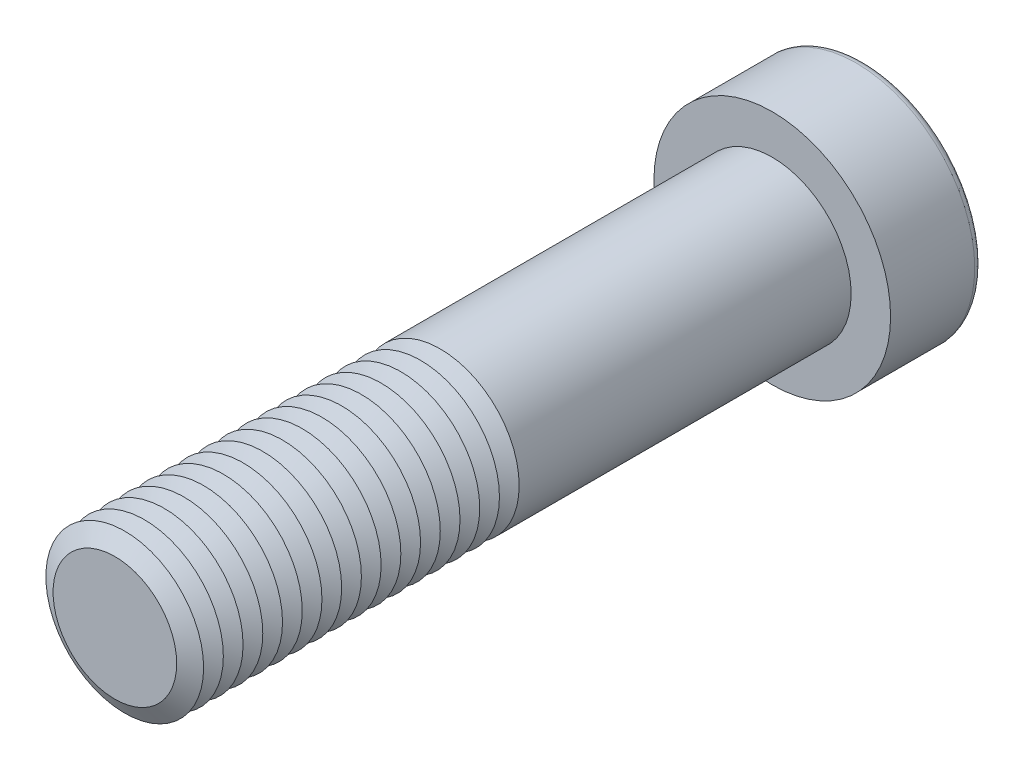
from build123d import *

# Parameters (mm, degrees)
SKETCH1_R           = 12
BOSS_EXTRUDE1_DEPTH = 100
SKETCH2_R           = 18
BOSS_EXTRUDE2_DEPTH = 14
CUT_EXTRUDE1_DEPTH  = 14.25
FILLET1_R           = 1.2
LPATTERN1_COUNT     = 17
LPATTERN1_PITCH     = 3


with BuildPart() as part:
    # Sketch1 → Boss-Extrude1 (new body)
    with BuildSketch(Plane.XY):
        Circle(SKETCH1_R)
    extrude(amount=BOSS_EXTRUDE1_DEPTH)

    # Sketch2 → Boss-Extrude2 (add)
    with BuildSketch(Plane(origin=(0, 0, 0), x_dir=(-1, 0, 0), z_dir=(0, 0, -1))):
        Circle(SKETCH2_R)
    extrude(amount=BOSS_EXTRUDE2_DEPTH)

    # Sketch3 → Cut-Extrude1 (cut)
    with BuildSketch(Plane(origin=(0, 0, -14), x_dir=(-1, 0, 0), z_dir=(0, 0, -1))):
        Polygon((-5.484827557, 9.5), (-10.969655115, 0), (-5.484827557, -9.5), (5.484827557, -9.5), (10.969655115, 0), (5.484827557, 9.5), align=None)
    extrude(amount=-CUT_EXTRUDE1_DEPTH, mode=Mode.SUBTRACT)

    # Fillet1
    fillet1_edges = [part.edges().sort_by_distance(p)[0] for p in [
        (18, 0, -14),
    ]]
    fillet(fillet1_edges, radius=FILLET1_R)

    # Cut-Extrude2 cone 1 section (on through the dimple's axis) → Cut-Extrude2 (revolve, cut)
    with BuildSketch(Plane(origin=(0, 0, 0.25), x_dir=(0, 1, 0), z_dir=(1, 0, 0))):
        Polygon((0, 0), (9.5, 0), (0, 5.484827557), align=None)
    revolve(axis=Axis((0, 0, 0.25), (0, 0, 1)), mode=Mode.SUBTRACT)

    # Cut-Extrude3 cone 1 section (on through the dimple's axis) → Cut-Extrude3 (revolve, cut)
    with BuildSketch(Plane(origin=(0, 0, -14), x_dir=(0, 1, 0), z_dir=(1, 0, 0))):
        Polygon((0, 0), (10.969655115, 0), (0, 2.939310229), align=None)
    revolve(axis=Axis((0, 0, -14), (0, 0, 1)), mode=Mode.SUBTRACT)

    # Sketch7 → Cut-Revolve1 (revolve, cut)
    with BuildSketch(Plane(origin=(0, 0, 0), x_dir=(0, 0, -1), z_dir=(1, 0, 0)), mode=Mode.PRIVATE) as cut_revolve1_sk:
        Polygon((-100, 9.401923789), (-98.5, 12), (-101.5, 12), align=None)
    cut_revolve1 = revolve(cut_revolve1_sk.sketch.rotate(Axis((0, 0, 100), (0, 0, -1)), 90), axis=Axis((0, 0, 100), (0, 0, -1)), mode=Mode.SUBTRACT)

    # LPattern1: Cut-Revolve1 ×17
    with Locations(*[(0, 0, -i * LPATTERN1_PITCH) for i in range(1, LPATTERN1_COUNT)]):
        add(cut_revolve1, mode=Mode.SUBTRACT)


solid = part.part
